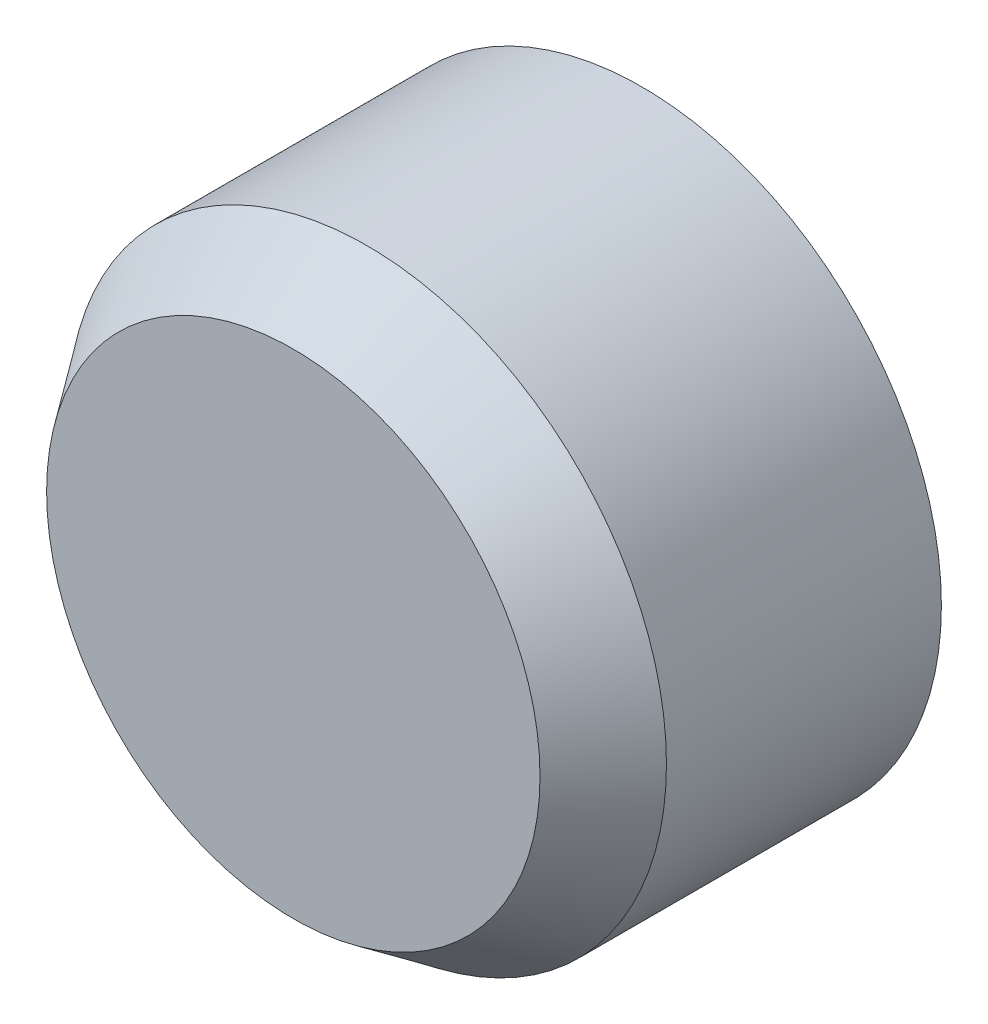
ISO-10303-21;
HEADER;
FILE_DESCRIPTION(('STEP AP214'),'2;1');
FILE_NAME('part.step','',(''),(''),'','','');
FILE_SCHEMA(('AUTOMOTIVE_DESIGN { 1 0 10303 214 1 1 1 1 }'));
ENDSEC;
DATA;
#1=APPLICATION_CONTEXT('core data for automotive mechanical design processes');
#2=APPLICATION_PROTOCOL_DEFINITION('international standard','automotive_design',2000,#1);
#3=PRODUCT_CONTEXT('',#1,'mechanical');
#4=PRODUCT('Part','Part','',(#3));
#5=PRODUCT_RELATED_PRODUCT_CATEGORY('part','',(#4));
#6=PRODUCT_DEFINITION_FORMATION('','',#4);
#7=PRODUCT_DEFINITION_CONTEXT('part definition',#1,'design');
#8=PRODUCT_DEFINITION('design','',#6,#7);
#9=PRODUCT_DEFINITION_SHAPE('','',#8);
#10=(LENGTH_UNIT() NAMED_UNIT(*) SI_UNIT(.MILLI.,.METRE.));
#11=(NAMED_UNIT(*) PLANE_ANGLE_UNIT() SI_UNIT($,.RADIAN.));
#12=(NAMED_UNIT(*) SI_UNIT($,.STERADIAN.) SOLID_ANGLE_UNIT());
#13=UNCERTAINTY_MEASURE_WITH_UNIT(LENGTH_MEASURE(1.E-05),#10,'distance_accuracy_value','');
#14=(GEOMETRIC_REPRESENTATION_CONTEXT(3) GLOBAL_UNCERTAINTY_ASSIGNED_CONTEXT((#13)) GLOBAL_UNIT_ASSIGNED_CONTEXT((#10,
#11,#12)) REPRESENTATION_CONTEXT('',''));
#15=CARTESIAN_POINT('',(0.,0.,0.));
#16=DIRECTION('',(0.,0.,1.));
#17=DIRECTION('',(1.,0.,0.));
#18=AXIS2_PLACEMENT_3D('',#15,#16,#17);
#19=CARTESIAN_POINT('',(0.,0.,36.068));
#20=DIRECTION('',(0.,0.,-1.));
#21=DIRECTION('',(-1.,0.,0.));
#22=AXIS2_PLACEMENT_3D('',#19,#20,#21);
#23=CYLINDRICAL_SURFACE('',#22,30.988);
#24=CARTESIAN_POINT('',(0.,0.,28.448));
#25=DIRECTION('',(0.,0.,1.));
#26=DIRECTION('',(1.,0.,0.));
#27=AXIS2_PLACEMENT_3D('',#24,#25,#26);
#28=CIRCLE('',#27,30.988);
#29=CARTESIAN_POINT('',(30.988,0.,28.448));
#30=VERTEX_POINT('',#29);
#31=EDGE_CURVE('E10',#30,#30,#28,.F.);
#32=ORIENTED_EDGE('',*,*,#31,.T.);
#33=EDGE_LOOP('',(#32));
#34=FACE_BOUND('',#33,.T.);
#35=CARTESIAN_POINT('',(0.,0.,0.));
#36=DIRECTION('',(0.,0.,1.));
#37=DIRECTION('',(1.,0.,0.));
#38=AXIS2_PLACEMENT_3D('',#35,#36,#37);
#39=CIRCLE('',#38,30.988);
#40=CARTESIAN_POINT('',(30.988,0.,0.));
#41=VERTEX_POINT('',#40);
#42=EDGE_CURVE('E39',#41,#41,#39,.T.);
#43=ORIENTED_EDGE('',*,*,#42,.T.);
#44=EDGE_LOOP('',(#43));
#45=FACE_BOUND('',#44,.T.);
#46=ADVANCED_FACE('F29',(#34,#45),#23,.T.);
#47=CARTESIAN_POINT('',(0.,0.,36.068));
#48=DIRECTION('',(0.,0.,1.));
#49=DIRECTION('',(1.,0.,0.));
#50=AXIS2_PLACEMENT_3D('',#47,#48,#49);
#51=PLANE('',#50);
#52=CARTESIAN_POINT('',(0.,0.,36.068));
#53=DIRECTION('',(0.,0.,1.));
#54=DIRECTION('',(1.,0.,0.));
#55=AXIS2_PLACEMENT_3D('',#52,#53,#54);
#56=CIRCLE('',#55,25.527);
#57=CARTESIAN_POINT('',(25.527,0.,36.068));
#58=VERTEX_POINT('',#57);
#59=EDGE_CURVE('E35',#58,#58,#56,.T.);
#60=ORIENTED_EDGE('',*,*,#59,.T.);
#61=EDGE_LOOP('',(#60));
#62=FACE_BOUND('',#61,.T.);
#63=ADVANCED_FACE('F50',(#62),#51,.T.);
#64=CARTESIAN_POINT('',(0.,0.,0.));
#65=DIRECTION('',(0.,0.,1.));
#66=DIRECTION('',(1.,0.,0.));
#67=AXIS2_PLACEMENT_3D('',#64,#65,#66);
#68=PLANE('',#67);
#69=ORIENTED_EDGE('',*,*,#42,.F.);
#70=EDGE_LOOP('',(#69));
#71=FACE_BOUND('',#70,.T.);
#72=ADVANCED_FACE('F47',(#71),#68,.F.);
#73=CARTESIAN_POINT('',(0.,0.,36.068));
#74=DIRECTION('',(0.,0.,-1.));
#75=DIRECTION('',(-1.,0.,0.));
#76=AXIS2_PLACEMENT_3D('',#73,#74,#75);
#77=CONICAL_SURFACE('',#76,25.527,0.62182428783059);
#78=ORIENTED_EDGE('',*,*,#31,.F.);
#79=EDGE_LOOP('',(#78));
#80=FACE_BOUND('',#79,.T.);
#81=ORIENTED_EDGE('',*,*,#59,.F.);
#82=EDGE_LOOP('',(#81));
#83=FACE_BOUND('',#82,.T.);
#84=ADVANCED_FACE('F49',(#80,#83),#77,.T.);
#85=CLOSED_SHELL('',(#46,#63,#72,#84));
#86=MANIFOLD_SOLID_BREP('B2',#85);
#87=ADVANCED_BREP_SHAPE_REPRESENTATION('',(#18,#86),#14);
#88=SHAPE_DEFINITION_REPRESENTATION(#9,#87);
ENDSEC;
END-ISO-10303-21;
